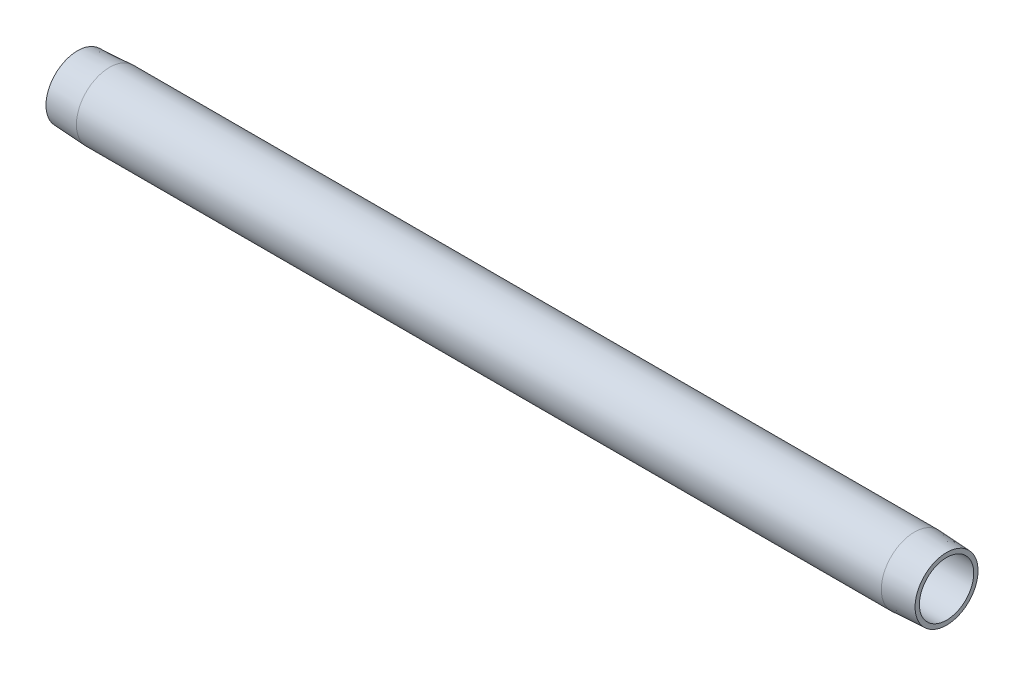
ISO-10303-21;
HEADER;
FILE_DESCRIPTION(('STEP AP214'),'2;1');
FILE_NAME('part.step','',(''),(''),'','','');
FILE_SCHEMA(('AUTOMOTIVE_DESIGN { 1 0 10303 214 1 1 1 1 }'));
ENDSEC;
DATA;
#1=APPLICATION_CONTEXT('core data for automotive mechanical design processes');
#2=APPLICATION_PROTOCOL_DEFINITION('international standard','automotive_design',2000,#1);
#3=PRODUCT_CONTEXT('',#1,'mechanical');
#4=PRODUCT('Part','Part','',(#3));
#5=PRODUCT_RELATED_PRODUCT_CATEGORY('part','',(#4));
#6=PRODUCT_DEFINITION_FORMATION('','',#4);
#7=PRODUCT_DEFINITION_CONTEXT('part definition',#1,'design');
#8=PRODUCT_DEFINITION('design','',#6,#7);
#9=PRODUCT_DEFINITION_SHAPE('','',#8);
#10=(LENGTH_UNIT() NAMED_UNIT(*) SI_UNIT(.MILLI.,.METRE.));
#11=(NAMED_UNIT(*) PLANE_ANGLE_UNIT() SI_UNIT($,.RADIAN.));
#12=(NAMED_UNIT(*) SI_UNIT($,.STERADIAN.) SOLID_ANGLE_UNIT());
#13=UNCERTAINTY_MEASURE_WITH_UNIT(LENGTH_MEASURE(1.E-05),#10,'distance_accuracy_value','');
#14=(GEOMETRIC_REPRESENTATION_CONTEXT(3) GLOBAL_UNCERTAINTY_ASSIGNED_CONTEXT((#13)) GLOBAL_UNIT_ASSIGNED_CONTEXT((#10,
#11,#12)) REPRESENTATION_CONTEXT('',''));
#15=CARTESIAN_POINT('',(0.,0.,0.));
#16=DIRECTION('',(0.,0.,1.));
#17=DIRECTION('',(1.,0.,0.));
#18=AXIS2_PLACEMENT_3D('',#15,#16,#17);
#19=CARTESIAN_POINT('',(279.4,8.73125,0.));
#20=DIRECTION('',(-1.,0.,0.));
#21=DIRECTION('',(0.,0.,1.));
#22=AXIS2_PLACEMENT_3D('',#19,#20,#21);
#23=PLANE('',#22);
#24=CARTESIAN_POINT('',(279.4,0.,0.));
#25=DIRECTION('',(-1.,0.,0.));
#26=DIRECTION('',(0.,0.,1.));
#27=AXIS2_PLACEMENT_3D('',#24,#25,#26);
#28=CIRCLE('',#27,10.1275500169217);
#29=CARTESIAN_POINT('',(279.4,0.,10.1275500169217));
#30=VERTEX_POINT('',#29);
#31=EDGE_CURVE('E10',#30,#30,#28,.T.);
#32=ORIENTED_EDGE('',*,*,#31,.F.);
#33=EDGE_LOOP('',(#32));
#34=FACE_BOUND('',#33,.T.);
#35=CARTESIAN_POINT('',(279.4,0.,0.));
#36=DIRECTION('',(-1.,0.,0.));
#37=DIRECTION('',(0.,0.,1.));
#38=AXIS2_PLACEMENT_3D('',#35,#36,#37);
#39=CIRCLE('',#38,8.73125);
#40=CARTESIAN_POINT('',(279.4,0.,8.73125));
#41=VERTEX_POINT('',#40);
#42=EDGE_CURVE('E52',#41,#41,#39,.T.);
#43=ORIENTED_EDGE('',*,*,#42,.T.);
#44=EDGE_LOOP('',(#43));
#45=FACE_BOUND('',#44,.T.);
#46=ADVANCED_FACE('F30',(#34,#45),#23,.F.);
#47=CARTESIAN_POINT('',(279.4,0.,0.));
#48=DIRECTION('',(-1.,0.,0.));
#49=DIRECTION('',(0.,0.,1.));
#50=AXIS2_PLACEMENT_3D('',#47,#48,#49);
#51=CONICAL_SURFACE('',#50,10.1275500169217,0.0523598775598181);
#52=CARTESIAN_POINT('',(269.0876,0.,0.));
#53=DIRECTION('',(-1.,0.,0.));
#54=DIRECTION('',(0.,0.,1.));
#55=AXIS2_PLACEMENT_3D('',#52,#53,#54);
#56=CIRCLE('',#55,10.668);
#57=CARTESIAN_POINT('',(269.0876,0.,10.668));
#58=VERTEX_POINT('',#57);
#59=EDGE_CURVE('E36',#58,#58,#56,.T.);
#60=ORIENTED_EDGE('',*,*,#59,.F.);
#61=EDGE_LOOP('',(#60));
#62=FACE_BOUND('',#61,.T.);
#63=ORIENTED_EDGE('',*,*,#31,.T.);
#64=EDGE_LOOP('',(#63));
#65=FACE_BOUND('',#64,.T.);
#66=ADVANCED_FACE('F77',(#62,#65),#51,.T.);
#67=CARTESIAN_POINT('',(0.,0.,0.));
#68=DIRECTION('',(-1.,0.,0.));
#69=DIRECTION('',(0.,0.,1.));
#70=AXIS2_PLACEMENT_3D('',#67,#68,#69);
#71=CYLINDRICAL_SURFACE('',#70,10.668);
#72=CARTESIAN_POINT('',(10.3124,0.,0.));
#73=DIRECTION('',(-1.,0.,0.));
#74=DIRECTION('',(0.,0.,1.));
#75=AXIS2_PLACEMENT_3D('',#72,#73,#74);
#76=CIRCLE('',#75,10.668);
#77=CARTESIAN_POINT('',(10.3124,0.,10.668));
#78=VERTEX_POINT('',#77);
#79=EDGE_CURVE('E40',#78,#78,#76,.T.);
#80=ORIENTED_EDGE('',*,*,#79,.F.);
#81=EDGE_LOOP('',(#80));
#82=FACE_BOUND('',#81,.T.);
#83=ORIENTED_EDGE('',*,*,#59,.T.);
#84=EDGE_LOOP('',(#83));
#85=FACE_BOUND('',#84,.T.);
#86=ADVANCED_FACE('F72',(#82,#85),#71,.T.);
#87=CARTESIAN_POINT('',(10.3124,0.,0.));
#88=DIRECTION('',(1.,0.,0.));
#89=DIRECTION('',(0.,0.,-1.));
#90=AXIS2_PLACEMENT_3D('',#87,#88,#89);
#91=CONICAL_SURFACE('',#90,10.668,0.0523598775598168);
#92=CARTESIAN_POINT('',(0.,0.,0.));
#93=DIRECTION('',(-1.,0.,0.));
#94=DIRECTION('',(0.,0.,1.));
#95=AXIS2_PLACEMENT_3D('',#92,#93,#94);
#96=CIRCLE('',#95,10.1275500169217);
#97=CARTESIAN_POINT('',(0.,0.,10.1275500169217));
#98=VERTEX_POINT('',#97);
#99=EDGE_CURVE('E44',#98,#98,#96,.T.);
#100=ORIENTED_EDGE('',*,*,#99,.F.);
#101=EDGE_LOOP('',(#100));
#102=FACE_BOUND('',#101,.T.);
#103=ORIENTED_EDGE('',*,*,#79,.T.);
#104=EDGE_LOOP('',(#103));
#105=FACE_BOUND('',#104,.T.);
#106=ADVANCED_FACE('F66',(#102,#105),#91,.T.);
#107=CARTESIAN_POINT('',(0.,10.1275500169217,0.));
#108=DIRECTION('',(1.,0.,0.));
#109=DIRECTION('',(0.,0.,-1.));
#110=AXIS2_PLACEMENT_3D('',#107,#108,#109);
#111=PLANE('',#110);
#112=CARTESIAN_POINT('',(0.,0.,0.));
#113=DIRECTION('',(-1.,0.,0.));
#114=DIRECTION('',(0.,0.,1.));
#115=AXIS2_PLACEMENT_3D('',#112,#113,#114);
#116=CIRCLE('',#115,8.73125);
#117=CARTESIAN_POINT('',(0.,0.,8.73125));
#118=VERTEX_POINT('',#117);
#119=EDGE_CURVE('E49',#118,#118,#116,.T.);
#120=ORIENTED_EDGE('',*,*,#119,.F.);
#121=EDGE_LOOP('',(#120));
#122=FACE_BOUND('',#121,.T.);
#123=ORIENTED_EDGE('',*,*,#99,.T.);
#124=EDGE_LOOP('',(#123));
#125=FACE_BOUND('',#124,.T.);
#126=ADVANCED_FACE('F60',(#122,#125),#111,.F.);
#127=CARTESIAN_POINT('',(0.,0.,0.));
#128=DIRECTION('',(-1.,0.,0.));
#129=DIRECTION('',(0.,0.,1.));
#130=AXIS2_PLACEMENT_3D('',#127,#128,#129);
#131=CYLINDRICAL_SURFACE('',#130,8.73125);
#132=ORIENTED_EDGE('',*,*,#42,.F.);
#133=EDGE_LOOP('',(#132));
#134=FACE_BOUND('',#133,.T.);
#135=ORIENTED_EDGE('',*,*,#119,.T.);
#136=EDGE_LOOP('',(#135));
#137=FACE_BOUND('',#136,.T.);
#138=ADVANCED_FACE('F57',(#134,#137),#131,.F.);
#139=CLOSED_SHELL('',(#46,#66,#86,#106,#126,#138));
#140=MANIFOLD_SOLID_BREP('B2',#139);
#141=ADVANCED_BREP_SHAPE_REPRESENTATION('',(#18,#140),#14);
#142=SHAPE_DEFINITION_REPRESENTATION(#9,#141);
ENDSEC;
END-ISO-10303-21;
